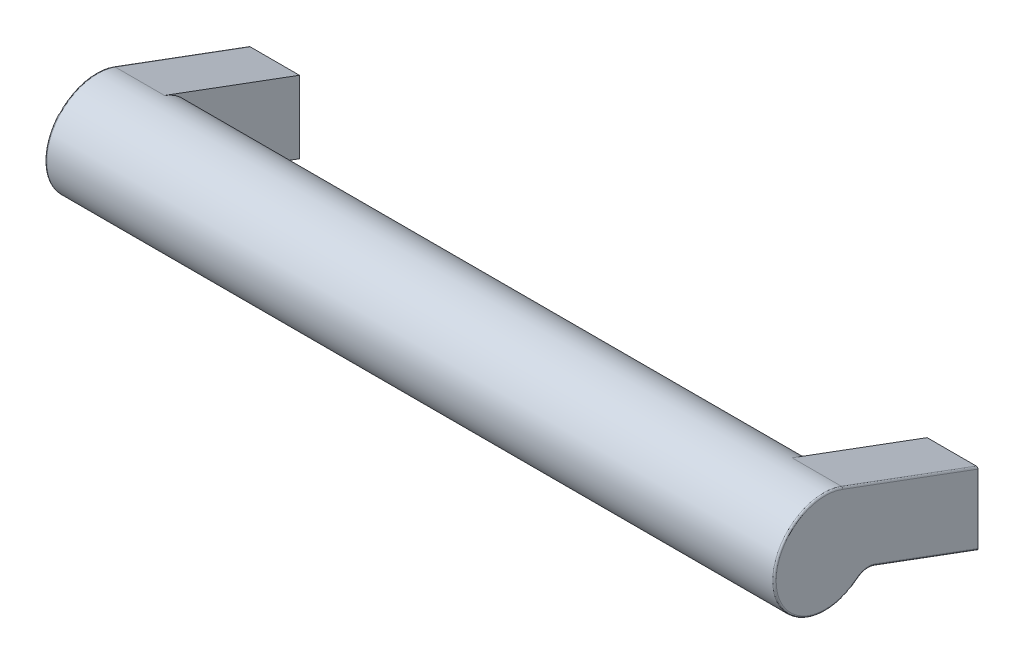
ISO-10303-21;
HEADER;
FILE_DESCRIPTION(('STEP AP214'),'2;1');
FILE_NAME('part.step','',(''),(''),'','','');
FILE_SCHEMA(('AUTOMOTIVE_DESIGN { 1 0 10303 214 1 1 1 1 }'));
ENDSEC;
DATA;
#1=APPLICATION_CONTEXT('core data for automotive mechanical design processes');
#2=APPLICATION_PROTOCOL_DEFINITION('international standard','automotive_design',2000,#1);
#3=PRODUCT_CONTEXT('',#1,'mechanical');
#4=PRODUCT('Part','Part','',(#3));
#5=PRODUCT_RELATED_PRODUCT_CATEGORY('part','',(#4));
#6=PRODUCT_DEFINITION_FORMATION('','',#4);
#7=PRODUCT_DEFINITION_CONTEXT('part definition',#1,'design');
#8=PRODUCT_DEFINITION('design','',#6,#7);
#9=PRODUCT_DEFINITION_SHAPE('','',#8);
#10=(LENGTH_UNIT() NAMED_UNIT(*) SI_UNIT(.MILLI.,.METRE.));
#11=(NAMED_UNIT(*) PLANE_ANGLE_UNIT() SI_UNIT($,.RADIAN.));
#12=(NAMED_UNIT(*) SI_UNIT($,.STERADIAN.) SOLID_ANGLE_UNIT());
#13=UNCERTAINTY_MEASURE_WITH_UNIT(LENGTH_MEASURE(1.E-05),#10,'distance_accuracy_value','');
#14=(GEOMETRIC_REPRESENTATION_CONTEXT(3) GLOBAL_UNCERTAINTY_ASSIGNED_CONTEXT((#13)) GLOBAL_UNIT_ASSIGNED_CONTEXT((#10,
#11,#12)) REPRESENTATION_CONTEXT('',''));
#15=CARTESIAN_POINT('',(0.,0.,0.));
#16=DIRECTION('',(0.,0.,1.));
#17=DIRECTION('',(1.,0.,0.));
#18=AXIS2_PLACEMENT_3D('',#15,#16,#17);
#19=CARTESIAN_POINT('',(142.5,11.,45.));
#20=DIRECTION('',(1.,0.,0.));
#21=DIRECTION('',(0.,1.,0.));
#22=AXIS2_PLACEMENT_3D('',#19,#20,#21);
#23=CYLINDRICAL_SURFACE('',#22,15.);
#24=CARTESIAN_POINT('',(7.5,11.,45.));
#25=DIRECTION('',(1.,0.,0.));
#26=DIRECTION('',(0.,1.,0.));
#27=AXIS2_PLACEMENT_3D('',#24,#25,#26);
#28=CIRCLE('',#27,15.);
#29=CARTESIAN_POINT('',(7.5,-0.545116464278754,35.4234512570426));
#30=VERTEX_POINT('',#29);
#31=CARTESIAN_POINT('',(7.5,25.0660927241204,39.7899102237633));
#32=VERTEX_POINT('',#31);
#33=EDGE_CURVE('E9',#30,#32,#28,.T.);
#34=ORIENTED_EDGE('',*,*,#33,.T.);
#35=DIRECTION('',(1.,0.,0.));
#36=VECTOR('',#35,1.);
#37=CARTESIAN_POINT('',(-7.5,25.0660927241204,39.7899102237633));
#38=LINE('',#37,#36);
#39=CARTESIAN_POINT('',(-7.,25.0660927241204,39.7899102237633));
#40=VERTEX_POINT('',#39);
#41=EDGE_CURVE('E373',#32,#40,#38,.F.);
#42=ORIENTED_EDGE('',*,*,#41,.T.);
#43=CARTESIAN_POINT('',(-7.,11.,45.));
#44=DIRECTION('',(1.,0.,0.));
#45=DIRECTION('',(0.,1.,0.));
#46=AXIS2_PLACEMENT_3D('',#43,#44,#45);
#47=CIRCLE('',#46,15.);
#48=CARTESIAN_POINT('',(-7.,-0.545116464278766,35.4234512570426));
#49=VERTEX_POINT('',#48);
#50=EDGE_CURVE('E354',#49,#40,#47,.F.);
#51=ORIENTED_EDGE('',*,*,#50,.F.);
#52=DIRECTION('',(1.,0.,0.));
#53=VECTOR('',#52,1.);
#54=CARTESIAN_POINT('',(-7.5,-0.545116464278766,35.4234512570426));
#55=LINE('',#54,#53);
#56=EDGE_CURVE('E372',#49,#30,#55,.T.);
#57=ORIENTED_EDGE('',*,*,#56,.T.);
#58=EDGE_LOOP('',(#34,#42,#51,#57));
#59=FACE_BOUND('',#58,.T.);
#60=DIRECTION('',(1.,0.,0.));
#61=VECTOR('',#60,1.);
#62=CARTESIAN_POINT('',(192.5,-0.545116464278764,35.4234512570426));
#63=LINE('',#62,#61);
#64=CARTESIAN_POINT('',(192.5,-0.545116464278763,35.4234512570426));
#65=VERTEX_POINT('',#64);
#66=CARTESIAN_POINT('',(207.,-0.545116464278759,35.4234512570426));
#67=VERTEX_POINT('',#66);
#68=EDGE_CURVE('E139',#65,#67,#63,.T.);
#69=ORIENTED_EDGE('',*,*,#68,.T.);
#70=CARTESIAN_POINT('',(207.,11.,45.));
#71=DIRECTION('',(1.,0.,0.));
#72=DIRECTION('',(0.,1.,0.));
#73=AXIS2_PLACEMENT_3D('',#70,#71,#72);
#74=CIRCLE('',#73,15.);
#75=CARTESIAN_POINT('',(207.,25.0660927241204,39.7899102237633));
#76=VERTEX_POINT('',#75);
#77=EDGE_CURVE('E166',#76,#67,#74,.T.);
#78=ORIENTED_EDGE('',*,*,#77,.F.);
#79=DIRECTION('',(1.,0.,0.));
#80=VECTOR('',#79,1.);
#81=CARTESIAN_POINT('',(192.5,25.0660927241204,39.7899102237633));
#82=LINE('',#81,#80);
#83=CARTESIAN_POINT('',(192.5,25.0660927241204,39.7899102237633));
#84=VERTEX_POINT('',#83);
#85=EDGE_CURVE('E142',#76,#84,#82,.F.);
#86=ORIENTED_EDGE('',*,*,#85,.T.);
#87=CARTESIAN_POINT('',(192.5,11.,45.));
#88=DIRECTION('',(1.,0.,0.));
#89=DIRECTION('',(0.,1.,0.));
#90=AXIS2_PLACEMENT_3D('',#87,#88,#89);
#91=CIRCLE('',#90,15.);
#92=EDGE_CURVE('E136',#65,#84,#91,.T.);
#93=ORIENTED_EDGE('',*,*,#92,.F.);
#94=EDGE_LOOP('',(#69,#78,#86,#93));
#95=FACE_BOUND('',#94,.T.);
#96=ADVANCED_FACE('F14',(#59,#95),#23,.T.);
#97=CARTESIAN_POINT('',(0.,0.,9.));
#98=DIRECTION('',(0.,0.,-1.));
#99=DIRECTION('',(1.,0.,0.));
#100=AXIS2_PLACEMENT_3D('',#97,#98,#99);
#101=PLANE('',#100);
#102=CARTESIAN_POINT('',(0.,0.,9.));
#103=DIRECTION('',(0.,0.,-1.));
#104=DIRECTION('',(1.,0.,0.));
#105=AXIS2_PLACEMENT_3D('',#102,#103,#104);
#106=CIRCLE('',#105,3.);
#107=CARTESIAN_POINT('',(3.,0.,9.));
#108=VERTEX_POINT('',#107);
#109=EDGE_CURVE('E208',#108,#108,#106,.T.);
#110=ORIENTED_EDGE('',*,*,#109,.T.);
#111=EDGE_LOOP('',(#110));
#112=FACE_BOUND('',#111,.T.);
#113=ADVANCED_FACE('F431',(#112),#101,.T.);
#114=CARTESIAN_POINT('',(-7.5,-4.39348861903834,32.2312683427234));
#115=DIRECTION('',(1.,0.,0.));
#116=DIRECTION('',(0.,1.,0.));
#117=AXIS2_PLACEMENT_3D('',#114,#115,#116);
#118=PLANE('',#117);
#119=CARTESIAN_POINT('',(-7.5,11.,45.));
#120=DIRECTION('',(1.,0.,0.));
#121=DIRECTION('',(0.,1.,0.));
#122=AXIS2_PLACEMENT_3D('',#119,#120,#121);
#123=CIRCLE('',#122,14.5);
#124=CARTESIAN_POINT('',(-7.5,25.5,45.));
#125=VERTEX_POINT('',#124);
#126=CARTESIAN_POINT('',(-7.5,-3.5,45.));
#127=VERTEX_POINT('',#126);
#128=EDGE_CURVE('E314',#125,#127,#123,.T.);
#129=ORIENTED_EDGE('',*,*,#128,.F.);
#130=CARTESIAN_POINT('',(-7.5,11.,45.));
#131=DIRECTION('',(1.,0.,0.));
#132=DIRECTION('',(0.,0.937739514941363,-0.347339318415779));
#133=AXIS2_PLACEMENT_3D('',#130,#131,#132);
#134=CIRCLE('',#133,14.5);
#135=CARTESIAN_POINT('',(-7.5,24.5972229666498,39.9635798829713));
#136=VERTEX_POINT('',#135);
#137=EDGE_CURVE('E302',#136,#125,#134,.T.);
#138=ORIENTED_EDGE('',*,*,#137,.F.);
#139=DIRECTION('',(0.,0.347339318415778,0.937739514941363));
#140=VECTOR('',#139,1.);
#141=CARTESIAN_POINT('',(-7.5,9.79468731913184,0.));
#142=LINE('',#141,#140);
#143=CARTESIAN_POINT('',(-7.5,9.79468731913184,0.));
#144=VERTEX_POINT('',#143);
#145=EDGE_CURVE('E328',#144,#136,#142,.T.);
#146=ORIENTED_EDGE('',*,*,#145,.F.);
#147=DIRECTION('',(0.,1.,0.));
#148=VECTOR('',#147,1.);
#149=CARTESIAN_POINT('',(-7.5,-4.39348861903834,0.));
#150=LINE('',#149,#148);
#151=CARTESIAN_POINT('',(-7.5,-10.466802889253,0.));
#152=VERTEX_POINT('',#151);
#153=EDGE_CURVE('E335',#152,#144,#150,.T.);
#154=ORIENTED_EDGE('',*,*,#153,.F.);
#155=DIRECTION('',(0.,-0.347339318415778,-0.937739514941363));
#156=VECTOR('',#155,1.);
#157=CARTESIAN_POINT('',(-7.5,0.764078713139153,30.3209020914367));
#158=LINE('',#157,#156);
#159=CARTESIAN_POINT('',(-7.5,0.764078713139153,30.3209020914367));
#160=VERTEX_POINT('',#159);
#161=EDGE_CURVE('E338',#160,#152,#158,.T.);
#162=ORIENTED_EDGE('',*,*,#161,.F.);
#163=CARTESIAN_POINT('',(-7.5,-4.39348861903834,32.2312683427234));
#164=DIRECTION('',(-1.,0.,0.));
#165=DIRECTION('',(0.,1.,0.));
#166=AXIS2_PLACEMENT_3D('',#163,#164,#165);
#167=CIRCLE('',#166,5.5);
#168=CARTESIAN_POINT('',(-7.5,1.10651138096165,32.2312683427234));
#169=VERTEX_POINT('',#168);
#170=EDGE_CURVE('E290',#169,#160,#167,.T.);
#171=ORIENTED_EDGE('',*,*,#170,.F.);
#172=CARTESIAN_POINT('',(-7.5,-4.39348861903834,32.2312683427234));
#173=DIRECTION('',(-1.,0.,0.));
#174=DIRECTION('',(0.,0.769674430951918,0.638436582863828));
#175=AXIS2_PLACEMENT_3D('',#172,#173,#174);
#176=CIRCLE('',#175,5.5);
#177=CARTESIAN_POINT('',(-7.5,-0.160279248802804,35.7426695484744));
#178=VERTEX_POINT('',#177);
#179=EDGE_CURVE('E249',#178,#169,#176,.T.);
#180=ORIENTED_EDGE('',*,*,#179,.F.);
#181=CARTESIAN_POINT('',(-7.5,11.,45.));
#182=DIRECTION('',(1.,0.,0.));
#183=DIRECTION('',(0.,-1.,0.));
#184=AXIS2_PLACEMENT_3D('',#181,#182,#183);
#185=CIRCLE('',#184,14.5);
#186=EDGE_CURVE('E21',#127,#178,#185,.T.);
#187=ORIENTED_EDGE('',*,*,#186,.F.);
#188=EDGE_LOOP('',(#129,#138,#146,#154,#162,#171,#180,#187));
#189=FACE_BOUND('',#188,.T.);
#190=ADVANCED_FACE('F268',(#189),#118,.F.);
#191=CARTESIAN_POINT('',(0.,0.,9.));
#192=DIRECTION('',(0.,0.,-1.));
#193=DIRECTION('',(1.,0.,0.));
#194=AXIS2_PLACEMENT_3D('',#191,#192,#193);
#195=CYLINDRICAL_SURFACE('',#194,3.);
#196=ORIENTED_EDGE('',*,*,#109,.F.);
#197=EDGE_LOOP('',(#196));
#198=FACE_BOUND('',#197,.T.);
#199=CARTESIAN_POINT('',(0.,0.,0.));
#200=DIRECTION('',(0.,0.,-1.));
#201=DIRECTION('',(1.,0.,0.));
#202=AXIS2_PLACEMENT_3D('',#199,#200,#201);
#203=CIRCLE('',#202,3.);
#204=CARTESIAN_POINT('',(3.,0.,0.));
#205=VERTEX_POINT('',#204);
#206=EDGE_CURVE('E205',#205,#205,#203,.T.);
#207=ORIENTED_EDGE('',*,*,#206,.T.);
#208=EDGE_LOOP('',(#207));
#209=FACE_BOUND('',#208,.T.);
#210=ADVANCED_FACE('F435',(#198,#209),#195,.F.);
#211=CARTESIAN_POINT('',(-7.,0.764078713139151,30.3209020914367));
#212=DIRECTION('',(0.,0.347339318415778,0.937739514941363));
#213=DIRECTION('',(0.,0.937739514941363,-0.347339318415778));
#214=AXIS2_PLACEMENT_3D('',#211,#212,#213);
#215=CYLINDRICAL_SURFACE('',#214,0.5);
#216=CARTESIAN_POINT('',(-7.,0.764078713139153,30.3209020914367));
#217=DIRECTION('',(0.,0.347339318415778,0.937739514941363));
#218=DIRECTION('',(0.,0.937739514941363,-0.347339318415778));
#219=AXIS2_PLACEMENT_3D('',#216,#217,#218);
#220=CIRCLE('',#219,0.5);
#221=CARTESIAN_POINT('',(-7.,0.29520895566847,30.4945717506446));
#222=VERTEX_POINT('',#221);
#223=EDGE_CURVE('E364',#222,#160,#220,.F.);
#224=ORIENTED_EDGE('',*,*,#223,.T.);
#225=ORIENTED_EDGE('',*,*,#161,.T.);
#226=CARTESIAN_POINT('',(-7.,-10.466802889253,0.));
#227=DIRECTION('',(0.,0.,1.));
#228=DIRECTION('',(0.,1.,0.));
#229=AXIS2_PLACEMENT_3D('',#226,#227,#228);
#230=ELLIPSE('',#229,0.53319711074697,0.5);
#231=CARTESIAN_POINT('',(-7.,-11.,0.));
#232=VERTEX_POINT('',#231);
#233=EDGE_CURVE('E366',#152,#232,#230,.T.);
#234=ORIENTED_EDGE('',*,*,#233,.T.);
#235=DIRECTION('',(0.,0.347339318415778,0.937739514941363));
#236=VECTOR('',#235,1.);
#237=CARTESIAN_POINT('',(-7.,0.295208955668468,30.4945717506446));
#238=LINE('',#237,#236);
#239=EDGE_CURVE('E217',#232,#222,#238,.T.);
#240=ORIENTED_EDGE('',*,*,#239,.T.);
#241=EDGE_LOOP('',(#224,#225,#234,#240));
#242=FACE_BOUND('',#241,.T.);
#243=ADVANCED_FACE('F226',(#242),#215,.T.);
#244=CARTESIAN_POINT('',(-7.,-4.39348861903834,32.2312683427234));
#245=DIRECTION('',(1.,0.,0.));
#246=DIRECTION('',(0.,1.,0.));
#247=AXIS2_PLACEMENT_3D('',#244,#245,#246);
#248=TOROIDAL_SURFACE('',#247,5.49999999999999,0.5);
#249=ORIENTED_EDGE('',*,*,#170,.T.);
#250=ORIENTED_EDGE('',*,*,#223,.F.);
#251=CARTESIAN_POINT('',(-7.,-4.39348861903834,32.2312683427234));
#252=DIRECTION('',(1.,0.,0.));
#253=DIRECTION('',(0.,1.,0.));
#254=AXIS2_PLACEMENT_3D('',#251,#252,#253);
#255=CIRCLE('',#254,5.);
#256=EDGE_CURVE('E382',#222,#49,#255,.T.);
#257=ORIENTED_EDGE('',*,*,#256,.T.);
#258=CARTESIAN_POINT('',(-7.,-0.160279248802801,35.7426695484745));
#259=DIRECTION('',(0.,0.638436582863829,-0.769674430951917));
#260=DIRECTION('',(0.,-0.769674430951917,-0.638436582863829));
#261=AXIS2_PLACEMENT_3D('',#258,#259,#260);
#262=CIRCLE('',#261,0.5);
#263=EDGE_CURVE('E347',#178,#49,#262,.F.);
#264=ORIENTED_EDGE('',*,*,#263,.F.);
#265=ORIENTED_EDGE('',*,*,#179,.T.);
#266=EDGE_LOOP('',(#249,#250,#257,#264,#265));
#267=FACE_BOUND('',#266,.T.);
#268=ADVANCED_FACE('F220',(#267),#248,.T.);
#269=CARTESIAN_POINT('',(-7.,18.5811294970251,23.7214550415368));
#270=DIRECTION('',(0.,-0.347339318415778,-0.937739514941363));
#271=DIRECTION('',(0.,-0.937739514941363,0.347339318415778));
#272=AXIS2_PLACEMENT_3D('',#269,#270,#271);
#273=CYLINDRICAL_SURFACE('',#272,0.5);
#274=CARTESIAN_POINT('',(-7.,9.79468731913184,0.));
#275=DIRECTION('',(0.,0.,1.));
#276=DIRECTION('',(0.,-1.,0.));
#277=AXIS2_PLACEMENT_3D('',#274,#275,#276);
#278=ELLIPSE('',#277,0.533197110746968,0.5);
#279=CARTESIAN_POINT('',(-7.,10.3278844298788,0.));
#280=VERTEX_POINT('',#279);
#281=EDGE_CURVE('E359',#280,#144,#278,.T.);
#282=ORIENTED_EDGE('',*,*,#281,.T.);
#283=ORIENTED_EDGE('',*,*,#145,.T.);
#284=CARTESIAN_POINT('',(-7.,24.5972229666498,39.9635798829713));
#285=DIRECTION('',(0.,0.347339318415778,0.937739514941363));
#286=DIRECTION('',(0.,0.937739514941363,-0.347339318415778));
#287=AXIS2_PLACEMENT_3D('',#284,#285,#286);
#288=CIRCLE('',#287,0.5);
#289=EDGE_CURVE('E355',#40,#136,#288,.T.);
#290=ORIENTED_EDGE('',*,*,#289,.F.);
#291=DIRECTION('',(0.,-0.347339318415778,-0.937739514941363));
#292=VECTOR('',#291,1.);
#293=CARTESIAN_POINT('',(-7.,19.0499992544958,23.547785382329));
#294=LINE('',#293,#292);
#295=EDGE_CURVE('E276',#40,#280,#294,.T.);
#296=ORIENTED_EDGE('',*,*,#295,.T.);
#297=EDGE_LOOP('',(#282,#283,#290,#296));
#298=FACE_BOUND('',#297,.T.);
#299=ADVANCED_FACE('F225',(#298),#273,.T.);
#300=CARTESIAN_POINT('',(-7.,11.,45.));
#301=DIRECTION('',(1.,0.,0.));
#302=DIRECTION('',(0.,1.,0.));
#303=AXIS2_PLACEMENT_3D('',#300,#301,#302);
#304=TOROIDAL_SURFACE('',#303,14.5,0.5);
#305=ORIENTED_EDGE('',*,*,#263,.T.);
#306=ORIENTED_EDGE('',*,*,#50,.T.);
#307=ORIENTED_EDGE('',*,*,#289,.T.);
#308=ORIENTED_EDGE('',*,*,#137,.T.);
#309=ORIENTED_EDGE('',*,*,#128,.T.);
#310=ORIENTED_EDGE('',*,*,#186,.T.);
#311=EDGE_LOOP('',(#305,#306,#307,#308,#309,#310));
#312=FACE_BOUND('',#311,.T.);
#313=ADVANCED_FACE('F256',(#312),#304,.T.);
#314=CARTESIAN_POINT('',(-7.5,10.3278844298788,0.));
#315=DIRECTION('',(0.,0.,1.));
#316=DIRECTION('',(-1.,0.,0.));
#317=AXIS2_PLACEMENT_3D('',#314,#315,#316);
#318=PLANE('',#317);
#319=ORIENTED_EDGE('',*,*,#206,.F.);
#320=EDGE_LOOP('',(#319));
#321=FACE_BOUND('',#320,.T.);
#322=ORIENTED_EDGE('',*,*,#281,.F.);
#323=DIRECTION('',(-1.,0.,0.));
#324=VECTOR('',#323,1.);
#325=CARTESIAN_POINT('',(-7.5,10.3278844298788,0.));
#326=LINE('',#325,#324);
#327=CARTESIAN_POINT('',(7.5,10.3278844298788,0.));
#328=VERTEX_POINT('',#327);
#329=EDGE_CURVE('E380',#328,#280,#326,.T.);
#330=ORIENTED_EDGE('',*,*,#329,.F.);
#331=DIRECTION('',(0.,-1.,0.));
#332=VECTOR('',#331,1.);
#333=CARTESIAN_POINT('',(7.5,10.3278844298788,0.));
#334=LINE('',#333,#332);
#335=CARTESIAN_POINT('',(7.5,-11.,0.));
#336=VERTEX_POINT('',#335);
#337=EDGE_CURVE('E377',#336,#328,#334,.F.);
#338=ORIENTED_EDGE('',*,*,#337,.F.);
#339=DIRECTION('',(-1.,0.,0.));
#340=VECTOR('',#339,1.);
#341=CARTESIAN_POINT('',(-7.5,-11.,0.));
#342=LINE('',#341,#340);
#343=EDGE_CURVE('E381',#232,#336,#342,.F.);
#344=ORIENTED_EDGE('',*,*,#343,.F.);
#345=ORIENTED_EDGE('',*,*,#233,.F.);
#346=ORIENTED_EDGE('',*,*,#153,.T.);
#347=EDGE_LOOP('',(#322,#330,#338,#344,#345,#346));
#348=FACE_BOUND('',#347,.T.);
#349=ADVANCED_FACE('F266',(#321,#348),#318,.F.);
#350=CARTESIAN_POINT('',(-7.5,-11.,0.));
#351=DIRECTION('',(0.,0.937739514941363,-0.347339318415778));
#352=DIRECTION('',(0.,-0.347339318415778,-0.937739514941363));
#353=AXIS2_PLACEMENT_3D('',#350,#351,#352);
#354=PLANE('',#353);
#355=ORIENTED_EDGE('',*,*,#239,.F.);
#356=ORIENTED_EDGE('',*,*,#343,.T.);
#357=DIRECTION('',(0.,-0.347339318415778,-0.937739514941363));
#358=VECTOR('',#357,1.);
#359=CARTESIAN_POINT('',(7.5,0.29520895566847,30.4945717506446));
#360=LINE('',#359,#358);
#361=CARTESIAN_POINT('',(7.5,0.29520895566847,30.4945717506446));
#362=VERTEX_POINT('',#361);
#363=EDGE_CURVE('E212',#362,#336,#360,.T.);
#364=ORIENTED_EDGE('',*,*,#363,.F.);
#365=DIRECTION('',(-1.,0.,0.));
#366=VECTOR('',#365,1.);
#367=CARTESIAN_POINT('',(-7.5,0.29520895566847,30.4945717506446));
#368=LINE('',#367,#366);
#369=EDGE_CURVE('E211',#222,#362,#368,.F.);
#370=ORIENTED_EDGE('',*,*,#369,.F.);
#371=EDGE_LOOP('',(#355,#356,#364,#370));
#372=FACE_BOUND('',#371,.T.);
#373=ADVANCED_FACE('F417',(#372),#354,.F.);
#374=CARTESIAN_POINT('',(-7.5,-4.39348861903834,32.2312683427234));
#375=DIRECTION('',(1.,0.,0.));
#376=DIRECTION('',(0.,1.,0.));
#377=AXIS2_PLACEMENT_3D('',#374,#375,#376);
#378=CYLINDRICAL_SURFACE('',#377,5.);
#379=ORIENTED_EDGE('',*,*,#256,.F.);
#380=ORIENTED_EDGE('',*,*,#369,.T.);
#381=CARTESIAN_POINT('',(7.5,-4.39348861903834,32.2312683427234));
#382=DIRECTION('',(1.,0.,0.));
#383=DIRECTION('',(0.,1.,0.));
#384=AXIS2_PLACEMENT_3D('',#381,#382,#383);
#385=CIRCLE('',#384,5.);
#386=EDGE_CURVE('E214',#30,#362,#385,.F.);
#387=ORIENTED_EDGE('',*,*,#386,.F.);
#388=ORIENTED_EDGE('',*,*,#56,.F.);
#389=EDGE_LOOP('',(#379,#380,#387,#388));
#390=FACE_BOUND('',#389,.T.);
#391=ADVANCED_FACE('F414',(#390),#378,.F.);
#392=CARTESIAN_POINT('',(-7.5,10.3278844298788,0.));
#393=DIRECTION('',(0.,-0.937739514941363,0.347339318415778));
#394=DIRECTION('',(0.,0.347339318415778,0.937739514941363));
#395=AXIS2_PLACEMENT_3D('',#392,#393,#394);
#396=PLANE('',#395);
#397=ORIENTED_EDGE('',*,*,#295,.F.);
#398=ORIENTED_EDGE('',*,*,#41,.F.);
#399=DIRECTION('',(0.,0.347339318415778,0.937739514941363));
#400=VECTOR('',#399,1.);
#401=CARTESIAN_POINT('',(7.5,10.3278844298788,0.));
#402=LINE('',#401,#400);
#403=EDGE_CURVE('E375',#328,#32,#402,.T.);
#404=ORIENTED_EDGE('',*,*,#403,.F.);
#405=ORIENTED_EDGE('',*,*,#329,.T.);
#406=EDGE_LOOP('',(#397,#398,#404,#405));
#407=FACE_BOUND('',#406,.T.);
#408=ADVANCED_FACE('F228',(#407),#396,.F.);
#409=CARTESIAN_POINT('',(7.5,-4.39348861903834,32.2312683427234));
#410=DIRECTION('',(1.,0.,0.));
#411=DIRECTION('',(0.,1.,0.));
#412=AXIS2_PLACEMENT_3D('',#409,#410,#411);
#413=PLANE('',#412);
#414=ORIENTED_EDGE('',*,*,#403,.T.);
#415=ORIENTED_EDGE('',*,*,#33,.F.);
#416=ORIENTED_EDGE('',*,*,#386,.T.);
#417=ORIENTED_EDGE('',*,*,#363,.T.);
#418=ORIENTED_EDGE('',*,*,#337,.T.);
#419=EDGE_LOOP('',(#414,#415,#416,#417,#418));
#420=FACE_BOUND('',#419,.T.);
#421=ADVANCED_FACE('F418',(#420),#413,.T.);
#422=CARTESIAN_POINT('',(200.,0.,9.));
#423=DIRECTION('',(0.,0.,-1.));
#424=DIRECTION('',(1.,0.,0.));
#425=AXIS2_PLACEMENT_3D('',#422,#423,#424);
#426=PLANE('',#425);
#427=CARTESIAN_POINT('',(200.,0.,9.));
#428=DIRECTION('',(0.,0.,-1.));
#429=DIRECTION('',(1.,0.,0.));
#430=AXIS2_PLACEMENT_3D('',#427,#428,#429);
#431=CIRCLE('',#430,3.);
#432=CARTESIAN_POINT('',(203.,0.,9.));
#433=VERTEX_POINT('',#432);
#434=EDGE_CURVE('E154',#433,#433,#431,.T.);
#435=ORIENTED_EDGE('',*,*,#434,.T.);
#436=EDGE_LOOP('',(#435));
#437=FACE_BOUND('',#436,.T.);
#438=ADVANCED_FACE('F420',(#437),#426,.T.);
#439=CARTESIAN_POINT('',(200.,0.,9.));
#440=DIRECTION('',(0.,0.,-1.));
#441=DIRECTION('',(1.,0.,0.));
#442=AXIS2_PLACEMENT_3D('',#439,#440,#441);
#443=CYLINDRICAL_SURFACE('',#442,3.);
#444=ORIENTED_EDGE('',*,*,#434,.F.);
#445=EDGE_LOOP('',(#444));
#446=FACE_BOUND('',#445,.T.);
#447=CARTESIAN_POINT('',(200.,0.,0.));
#448=DIRECTION('',(0.,0.,-1.));
#449=DIRECTION('',(1.,0.,0.));
#450=AXIS2_PLACEMENT_3D('',#447,#448,#449);
#451=CIRCLE('',#450,3.);
#452=CARTESIAN_POINT('',(203.,0.,0.));
#453=VERTEX_POINT('',#452);
#454=EDGE_CURVE('E202',#453,#453,#451,.T.);
#455=ORIENTED_EDGE('',*,*,#454,.T.);
#456=EDGE_LOOP('',(#455));
#457=FACE_BOUND('',#456,.T.);
#458=ADVANCED_FACE('F426',(#446,#457),#443,.F.);
#459=CARTESIAN_POINT('',(207.,-10.5311302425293,-0.173669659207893));
#460=DIRECTION('',(0.,-0.347339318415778,-0.937739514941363));
#461=DIRECTION('',(0.,-0.937739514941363,0.347339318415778));
#462=AXIS2_PLACEMENT_3D('',#459,#460,#461);
#463=CYLINDRICAL_SURFACE('',#462,0.5);
#464=CARTESIAN_POINT('',(207.,0.764078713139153,30.3209020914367));
#465=DIRECTION('',(0.,-0.347339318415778,-0.937739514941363));
#466=DIRECTION('',(0.,-0.937739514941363,0.347339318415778));
#467=AXIS2_PLACEMENT_3D('',#464,#465,#466);
#468=CIRCLE('',#467,0.5);
#469=CARTESIAN_POINT('',(207.5,0.764078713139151,30.3209020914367));
#470=VERTEX_POINT('',#469);
#471=CARTESIAN_POINT('',(207.,0.29520895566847,30.4945717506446));
#472=VERTEX_POINT('',#471);
#473=EDGE_CURVE('E162',#470,#472,#468,.T.);
#474=ORIENTED_EDGE('',*,*,#473,.T.);
#475=DIRECTION('',(0.,-0.347339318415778,-0.937739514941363));
#476=VECTOR('',#475,1.);
#477=CARTESIAN_POINT('',(207.,-11.,0.));
#478=LINE('',#477,#476);
#479=CARTESIAN_POINT('',(207.,-11.,0.));
#480=VERTEX_POINT('',#479);
#481=EDGE_CURVE('E198',#472,#480,#478,.T.);
#482=ORIENTED_EDGE('',*,*,#481,.T.);
#483=CARTESIAN_POINT('',(207.,-10.466802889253,0.));
#484=DIRECTION('',(0.,0.,1.));
#485=DIRECTION('',(0.,-1.,0.));
#486=AXIS2_PLACEMENT_3D('',#483,#484,#485);
#487=ELLIPSE('',#486,0.53319711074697,0.5);
#488=CARTESIAN_POINT('',(207.5,-10.466802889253,0.));
#489=VERTEX_POINT('',#488);
#490=EDGE_CURVE('E594',#480,#489,#487,.T.);
#491=ORIENTED_EDGE('',*,*,#490,.T.);
#492=DIRECTION('',(0.,-0.347339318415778,-0.937739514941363));
#493=VECTOR('',#492,1.);
#494=CARTESIAN_POINT('',(207.5,0.764078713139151,30.3209020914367));
#495=LINE('',#494,#493);
#496=EDGE_CURVE('E617',#470,#489,#495,.T.);
#497=ORIENTED_EDGE('',*,*,#496,.F.);
#498=EDGE_LOOP('',(#474,#482,#491,#497));
#499=FACE_BOUND('',#498,.T.);
#500=ADVANCED_FACE('F190',(#499),#463,.T.);
#501=CARTESIAN_POINT('',(192.5,10.3278844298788,0.));
#502=DIRECTION('',(0.,0.,1.));
#503=DIRECTION('',(-1.,0.,0.));
#504=AXIS2_PLACEMENT_3D('',#501,#502,#503);
#505=PLANE('',#504);
#506=ORIENTED_EDGE('',*,*,#454,.F.);
#507=EDGE_LOOP('',(#506));
#508=FACE_BOUND('',#507,.T.);
#509=ORIENTED_EDGE('',*,*,#490,.F.);
#510=DIRECTION('',(-1.,0.,0.));
#511=VECTOR('',#510,1.);
#512=CARTESIAN_POINT('',(192.5,-11.,0.));
#513=LINE('',#512,#511);
#514=CARTESIAN_POINT('',(192.5,-11.,0.));
#515=VERTEX_POINT('',#514);
#516=EDGE_CURVE('E593',#515,#480,#513,.F.);
#517=ORIENTED_EDGE('',*,*,#516,.F.);
#518=DIRECTION('',(0.,-1.,0.));
#519=VECTOR('',#518,1.);
#520=CARTESIAN_POINT('',(192.5,10.3278844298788,0.));
#521=LINE('',#520,#519);
#522=CARTESIAN_POINT('',(192.5,10.3278844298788,0.));
#523=VERTEX_POINT('',#522);
#524=EDGE_CURVE('E592',#523,#515,#521,.T.);
#525=ORIENTED_EDGE('',*,*,#524,.F.);
#526=DIRECTION('',(-1.,0.,0.));
#527=VECTOR('',#526,1.);
#528=CARTESIAN_POINT('',(192.5,10.3278844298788,0.));
#529=LINE('',#528,#527);
#530=CARTESIAN_POINT('',(207.,10.3278844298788,0.));
#531=VERTEX_POINT('',#530);
#532=EDGE_CURVE('E590',#531,#523,#529,.T.);
#533=ORIENTED_EDGE('',*,*,#532,.F.);
#534=CARTESIAN_POINT('',(207.,9.79468731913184,0.));
#535=DIRECTION('',(0.,0.,1.));
#536=DIRECTION('',(0.,1.,0.));
#537=AXIS2_PLACEMENT_3D('',#534,#535,#536);
#538=ELLIPSE('',#537,0.533197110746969,0.5);
#539=CARTESIAN_POINT('',(207.5,9.79468731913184,0.));
#540=VERTEX_POINT('',#539);
#541=EDGE_CURVE('E589',#540,#531,#538,.T.);
#542=ORIENTED_EDGE('',*,*,#541,.F.);
#543=DIRECTION('',(0.,1.,0.));
#544=VECTOR('',#543,1.);
#545=CARTESIAN_POINT('',(207.5,-4.39348861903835,0.));
#546=LINE('',#545,#544);
#547=EDGE_CURVE('E613',#489,#540,#546,.T.);
#548=ORIENTED_EDGE('',*,*,#547,.F.);
#549=EDGE_LOOP('',(#509,#517,#525,#533,#542,#548));
#550=FACE_BOUND('',#549,.T.);
#551=ADVANCED_FACE('F495',(#508,#550),#505,.F.);
#552=CARTESIAN_POINT('',(207.,9.85901467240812,0.173669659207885));
#553=DIRECTION('',(0.,0.347339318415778,0.937739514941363));
#554=DIRECTION('',(0.,0.937739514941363,-0.347339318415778));
#555=AXIS2_PLACEMENT_3D('',#552,#553,#554);
#556=CYLINDRICAL_SURFACE('',#555,0.5);
#557=CARTESIAN_POINT('',(207.,24.5972229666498,39.9635798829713));
#558=DIRECTION('',(0.,0.347339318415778,0.937739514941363));
#559=DIRECTION('',(0.,0.937739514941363,-0.347339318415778));
#560=AXIS2_PLACEMENT_3D('',#557,#558,#559);
#561=CIRCLE('',#560,0.5);
#562=CARTESIAN_POINT('',(207.5,24.5972229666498,39.9635798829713));
#563=VERTEX_POINT('',#562);
#564=EDGE_CURVE('E169',#563,#76,#561,.T.);
#565=ORIENTED_EDGE('',*,*,#564,.F.);
#566=DIRECTION('',(0.,0.347339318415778,0.937739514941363));
#567=VECTOR('',#566,1.);
#568=CARTESIAN_POINT('',(207.5,9.79468731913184,0.));
#569=LINE('',#568,#567);
#570=EDGE_CURVE('E618',#540,#563,#569,.T.);
#571=ORIENTED_EDGE('',*,*,#570,.F.);
#572=ORIENTED_EDGE('',*,*,#541,.T.);
#573=DIRECTION('',(0.,0.347339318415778,0.937739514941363));
#574=VECTOR('',#573,1.);
#575=CARTESIAN_POINT('',(207.,10.3278844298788,0.));
#576=LINE('',#575,#574);
#577=EDGE_CURVE('E586',#531,#76,#576,.T.);
#578=ORIENTED_EDGE('',*,*,#577,.T.);
#579=EDGE_LOOP('',(#565,#571,#572,#578));
#580=FACE_BOUND('',#579,.T.);
#581=ADVANCED_FACE('F504',(#580),#556,.T.);
#582=CARTESIAN_POINT('',(207.5,-4.39348861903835,32.2312683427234));
#583=DIRECTION('',(1.,0.,0.));
#584=DIRECTION('',(0.,1.,0.));
#585=AXIS2_PLACEMENT_3D('',#582,#583,#584);
#586=PLANE('',#585);
#587=CARTESIAN_POINT('',(207.5,11.,45.));
#588=DIRECTION('',(-1.,0.,0.));
#589=DIRECTION('',(0.,-1.,0.));
#590=AXIS2_PLACEMENT_3D('',#587,#588,#589);
#591=CIRCLE('',#590,14.5);
#592=CARTESIAN_POINT('',(207.5,25.5,45.));
#593=VERTEX_POINT('',#592);
#594=CARTESIAN_POINT('',(207.5,-3.5,45.));
#595=VERTEX_POINT('',#594);
#596=EDGE_CURVE('E655',#593,#595,#591,.F.);
#597=ORIENTED_EDGE('',*,*,#596,.T.);
#598=CARTESIAN_POINT('',(207.5,11.,45.));
#599=DIRECTION('',(-1.,0.,0.));
#600=DIRECTION('',(0.,-0.769674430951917,-0.638436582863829));
#601=AXIS2_PLACEMENT_3D('',#598,#599,#600);
#602=CIRCLE('',#601,14.5);
#603=CARTESIAN_POINT('',(207.5,-0.160279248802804,35.7426695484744));
#604=VERTEX_POINT('',#603);
#605=EDGE_CURVE('E145',#595,#604,#602,.F.);
#606=ORIENTED_EDGE('',*,*,#605,.T.);
#607=CARTESIAN_POINT('',(207.5,-4.39348861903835,32.2312683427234));
#608=DIRECTION('',(1.,0.,0.));
#609=DIRECTION('',(0.,1.,0.));
#610=AXIS2_PLACEMENT_3D('',#607,#608,#609);
#611=CIRCLE('',#610,5.5);
#612=CARTESIAN_POINT('',(207.5,1.10651138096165,32.2312683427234));
#613=VERTEX_POINT('',#612);
#614=EDGE_CURVE('E626',#604,#613,#611,.F.);
#615=ORIENTED_EDGE('',*,*,#614,.T.);
#616=CARTESIAN_POINT('',(207.5,-4.39348861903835,32.2312683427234));
#617=DIRECTION('',(1.,0.,0.));
#618=DIRECTION('',(0.,0.937739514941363,-0.347339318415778));
#619=AXIS2_PLACEMENT_3D('',#616,#617,#618);
#620=CIRCLE('',#619,5.5);
#621=EDGE_CURVE('E622',#613,#470,#620,.F.);
#622=ORIENTED_EDGE('',*,*,#621,.T.);
#623=ORIENTED_EDGE('',*,*,#496,.T.);
#624=ORIENTED_EDGE('',*,*,#547,.T.);
#625=ORIENTED_EDGE('',*,*,#570,.T.);
#626=CARTESIAN_POINT('',(207.5,11.,45.));
#627=DIRECTION('',(-1.,0.,0.));
#628=DIRECTION('',(0.,1.,0.));
#629=AXIS2_PLACEMENT_3D('',#626,#627,#628);
#630=CIRCLE('',#629,14.5);
#631=EDGE_CURVE('E634',#563,#593,#630,.F.);
#632=ORIENTED_EDGE('',*,*,#631,.T.);
#633=EDGE_LOOP('',(#597,#606,#615,#622,#623,#624,#625,#632));
#634=FACE_BOUND('',#633,.T.);
#635=ADVANCED_FACE('F188',(#634),#586,.T.);
#636=CARTESIAN_POINT('',(207.,-4.39348861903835,32.2312683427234));
#637=DIRECTION('',(1.,0.,0.));
#638=DIRECTION('',(0.,1.,0.));
#639=AXIS2_PLACEMENT_3D('',#636,#637,#638);
#640=TOROIDAL_SURFACE('',#639,5.5,0.5);
#641=CARTESIAN_POINT('',(207.,-4.39348861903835,32.2312683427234));
#642=DIRECTION('',(1.,0.,0.));
#643=DIRECTION('',(0.,1.,0.));
#644=AXIS2_PLACEMENT_3D('',#641,#642,#643);
#645=CIRCLE('',#644,5.);
#646=EDGE_CURVE('E158',#67,#472,#645,.F.);
#647=ORIENTED_EDGE('',*,*,#646,.T.);
#648=ORIENTED_EDGE('',*,*,#473,.F.);
#649=ORIENTED_EDGE('',*,*,#621,.F.);
#650=ORIENTED_EDGE('',*,*,#614,.F.);
#651=CARTESIAN_POINT('',(207.,-0.160279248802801,35.7426695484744));
#652=DIRECTION('',(0.,0.638436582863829,-0.769674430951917));
#653=DIRECTION('',(0.,-0.769674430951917,-0.638436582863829));
#654=AXIS2_PLACEMENT_3D('',#651,#652,#653);
#655=CIRCLE('',#654,0.5);
#656=EDGE_CURVE('E170',#67,#604,#655,.F.);
#657=ORIENTED_EDGE('',*,*,#656,.F.);
#658=EDGE_LOOP('',(#647,#648,#649,#650,#657));
#659=FACE_BOUND('',#658,.T.);
#660=ADVANCED_FACE('F176',(#659),#640,.T.);
#661=CARTESIAN_POINT('',(192.5,-11.,0.));
#662=DIRECTION('',(0.,0.937739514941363,-0.347339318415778));
#663=DIRECTION('',(0.,-0.347339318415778,-0.937739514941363));
#664=AXIS2_PLACEMENT_3D('',#661,#662,#663);
#665=PLANE('',#664);
#666=ORIENTED_EDGE('',*,*,#481,.F.);
#667=DIRECTION('',(-1.,0.,0.));
#668=VECTOR('',#667,1.);
#669=CARTESIAN_POINT('',(192.5,0.29520895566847,30.4945717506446));
#670=LINE('',#669,#668);
#671=CARTESIAN_POINT('',(192.5,0.29520895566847,30.4945717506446));
#672=VERTEX_POINT('',#671);
#673=EDGE_CURVE('E607',#672,#472,#670,.F.);
#674=ORIENTED_EDGE('',*,*,#673,.F.);
#675=DIRECTION('',(0.,-0.347339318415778,-0.937739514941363));
#676=VECTOR('',#675,1.);
#677=CARTESIAN_POINT('',(192.5,-11.,0.));
#678=LINE('',#677,#676);
#679=EDGE_CURVE('E151',#515,#672,#678,.F.);
#680=ORIENTED_EDGE('',*,*,#679,.F.);
#681=ORIENTED_EDGE('',*,*,#516,.T.);
#682=EDGE_LOOP('',(#666,#674,#680,#681));
#683=FACE_BOUND('',#682,.T.);
#684=ADVANCED_FACE('F187',(#683),#665,.F.);
#685=CARTESIAN_POINT('',(192.5,-4.39348861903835,32.2312683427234));
#686=DIRECTION('',(1.,0.,0.));
#687=DIRECTION('',(0.,1.,0.));
#688=AXIS2_PLACEMENT_3D('',#685,#686,#687);
#689=PLANE('',#688);
#690=CARTESIAN_POINT('',(192.5,-4.39348861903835,32.2312683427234));
#691=DIRECTION('',(1.,0.,0.));
#692=DIRECTION('',(0.,1.,0.));
#693=AXIS2_PLACEMENT_3D('',#690,#691,#692);
#694=CIRCLE('',#693,5.);
#695=EDGE_CURVE('E148',#65,#672,#694,.F.);
#696=ORIENTED_EDGE('',*,*,#695,.F.);
#697=ORIENTED_EDGE('',*,*,#92,.T.);
#698=DIRECTION('',(0.,0.347339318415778,0.937739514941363));
#699=VECTOR('',#698,1.);
#700=CARTESIAN_POINT('',(192.5,10.3278844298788,0.));
#701=LINE('',#700,#699);
#702=EDGE_CURVE('E160',#84,#523,#701,.F.);
#703=ORIENTED_EDGE('',*,*,#702,.T.);
#704=ORIENTED_EDGE('',*,*,#524,.T.);
#705=ORIENTED_EDGE('',*,*,#679,.T.);
#706=EDGE_LOOP('',(#696,#697,#703,#704,#705));
#707=FACE_BOUND('',#706,.T.);
#708=ADVANCED_FACE('F149',(#707),#689,.F.);
#709=CARTESIAN_POINT('',(192.5,10.3278844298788,0.));
#710=DIRECTION('',(0.,-0.937739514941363,0.347339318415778));
#711=DIRECTION('',(0.,0.347339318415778,0.937739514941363));
#712=AXIS2_PLACEMENT_3D('',#709,#710,#711);
#713=PLANE('',#712);
#714=ORIENTED_EDGE('',*,*,#577,.F.);
#715=ORIENTED_EDGE('',*,*,#532,.T.);
#716=ORIENTED_EDGE('',*,*,#702,.F.);
#717=ORIENTED_EDGE('',*,*,#85,.F.);
#718=EDGE_LOOP('',(#714,#715,#716,#717));
#719=FACE_BOUND('',#718,.T.);
#720=ADVANCED_FACE('F192',(#719),#713,.F.);
#721=CARTESIAN_POINT('',(207.,11.,45.));
#722=DIRECTION('',(1.,0.,0.));
#723=DIRECTION('',(0.,1.,0.));
#724=AXIS2_PLACEMENT_3D('',#721,#722,#723);
#725=TOROIDAL_SURFACE('',#724,14.5,0.5);
#726=ORIENTED_EDGE('',*,*,#656,.T.);
#727=ORIENTED_EDGE('',*,*,#605,.F.);
#728=ORIENTED_EDGE('',*,*,#596,.F.);
#729=ORIENTED_EDGE('',*,*,#631,.F.);
#730=ORIENTED_EDGE('',*,*,#564,.T.);
#731=ORIENTED_EDGE('',*,*,#77,.T.);
#732=EDGE_LOOP('',(#726,#727,#728,#729,#730,#731));
#733=FACE_BOUND('',#732,.T.);
#734=ADVANCED_FACE('F553',(#733),#725,.T.);
#735=CARTESIAN_POINT('',(192.5,-4.39348861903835,32.2312683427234));
#736=DIRECTION('',(1.,0.,0.));
#737=DIRECTION('',(0.,1.,0.));
#738=AXIS2_PLACEMENT_3D('',#735,#736,#737);
#739=CYLINDRICAL_SURFACE('',#738,5.);
#740=ORIENTED_EDGE('',*,*,#695,.T.);
#741=ORIENTED_EDGE('',*,*,#673,.T.);
#742=ORIENTED_EDGE('',*,*,#646,.F.);
#743=ORIENTED_EDGE('',*,*,#68,.F.);
#744=EDGE_LOOP('',(#740,#741,#742,#743));
#745=FACE_BOUND('',#744,.T.);
#746=ADVANCED_FACE('F156',(#745),#739,.F.);
#747=CLOSED_SHELL('',(#96,#113,#190,#210,#243,#268,#299,#313,#349,#373,#391,#408,#421,#438,#458,
#500,#551,#581,#635,#660,#684,#708,#720,#734,#746));
#748=MANIFOLD_SOLID_BREP('B1',#747);
#749=ADVANCED_BREP_SHAPE_REPRESENTATION('',(#18,#748),#14);
#750=SHAPE_DEFINITION_REPRESENTATION(#9,#749);
ENDSEC;
END-ISO-10303-21;
